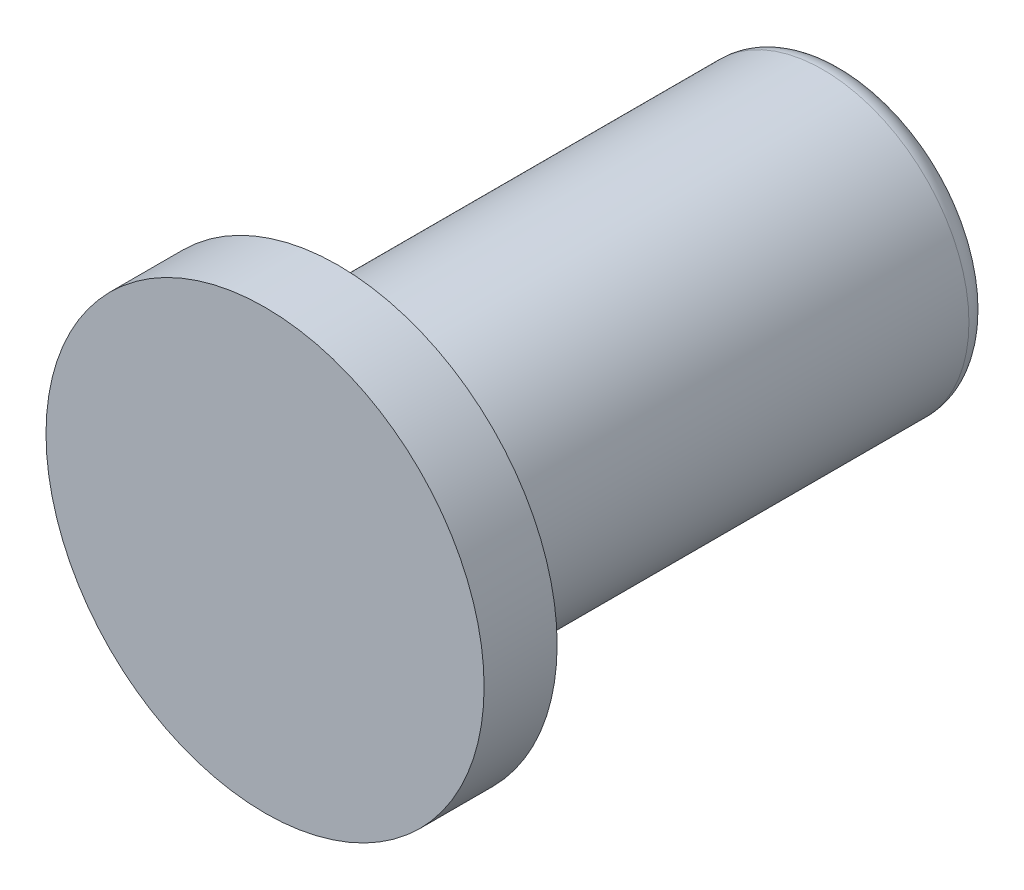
ISO-10303-21;
HEADER;
FILE_DESCRIPTION(('STEP AP214'),'2;1');
FILE_NAME('part.step','',(''),(''),'','','');
FILE_SCHEMA(('AUTOMOTIVE_DESIGN { 1 0 10303 214 1 1 1 1 }'));
ENDSEC;
DATA;
#1=APPLICATION_CONTEXT('core data for automotive mechanical design processes');
#2=APPLICATION_PROTOCOL_DEFINITION('international standard','automotive_design',2000,#1);
#3=PRODUCT_CONTEXT('',#1,'mechanical');
#4=PRODUCT('Part','Part','',(#3));
#5=PRODUCT_RELATED_PRODUCT_CATEGORY('part','',(#4));
#6=PRODUCT_DEFINITION_FORMATION('','',#4);
#7=PRODUCT_DEFINITION_CONTEXT('part definition',#1,'design');
#8=PRODUCT_DEFINITION('design','',#6,#7);
#9=PRODUCT_DEFINITION_SHAPE('','',#8);
#10=(LENGTH_UNIT() NAMED_UNIT(*) SI_UNIT(.MILLI.,.METRE.));
#11=(NAMED_UNIT(*) PLANE_ANGLE_UNIT() SI_UNIT($,.RADIAN.));
#12=(NAMED_UNIT(*) SI_UNIT($,.STERADIAN.) SOLID_ANGLE_UNIT());
#13=UNCERTAINTY_MEASURE_WITH_UNIT(LENGTH_MEASURE(1.E-05),#10,'distance_accuracy_value','');
#14=(GEOMETRIC_REPRESENTATION_CONTEXT(3) GLOBAL_UNCERTAINTY_ASSIGNED_CONTEXT((#13)) GLOBAL_UNIT_ASSIGNED_CONTEXT((#10,
#11,#12)) REPRESENTATION_CONTEXT('',''));
#15=CARTESIAN_POINT('',(0.,0.,0.));
#16=DIRECTION('',(0.,0.,1.));
#17=DIRECTION('',(1.,0.,0.));
#18=AXIS2_PLACEMENT_3D('',#15,#16,#17);
#19=CARTESIAN_POINT('',(0.,0.,0.));
#20=DIRECTION('',(0.,0.,-1.));
#21=DIRECTION('',(-1.,0.,0.));
#22=AXIS2_PLACEMENT_3D('',#19,#20,#21);
#23=PLANE('',#22);
#24=CARTESIAN_POINT('',(0.,0.,0.));
#25=DIRECTION('',(0.,0.,1.));
#26=DIRECTION('',(1.,0.,0.));
#27=AXIS2_PLACEMENT_3D('',#24,#25,#26);
#28=CIRCLE('',#27,15.);
#29=CARTESIAN_POINT('',(15.,0.,0.));
#30=VERTEX_POINT('',#29);
#31=EDGE_CURVE('E11',#30,#30,#28,.T.);
#32=ORIENTED_EDGE('',*,*,#31,.T.);
#33=EDGE_LOOP('',(#32));
#34=FACE_BOUND('',#33,.T.);
#35=ADVANCED_FACE('F33',(#34),#23,.F.);
#36=CARTESIAN_POINT('',(0.,0.,0.));
#37=DIRECTION('',(0.,0.,1.));
#38=DIRECTION('',(1.,0.,0.));
#39=AXIS2_PLACEMENT_3D('',#36,#37,#38);
#40=CYLINDRICAL_SURFACE('',#39,15.);
#41=ORIENTED_EDGE('',*,*,#31,.F.);
#42=EDGE_LOOP('',(#41));
#43=FACE_BOUND('',#42,.T.);
#44=CARTESIAN_POINT('',(0.,0.,-5.));
#45=DIRECTION('',(0.,0.,1.));
#46=DIRECTION('',(1.,0.,0.));
#47=AXIS2_PLACEMENT_3D('',#44,#45,#46);
#48=CIRCLE('',#47,15.);
#49=CARTESIAN_POINT('',(15.,0.,-5.));
#50=VERTEX_POINT('',#49);
#51=EDGE_CURVE('E39',#50,#50,#48,.T.);
#52=ORIENTED_EDGE('',*,*,#51,.T.);
#53=EDGE_LOOP('',(#52));
#54=FACE_BOUND('',#53,.T.);
#55=ADVANCED_FACE('F55',(#43,#54),#40,.T.);
#56=CARTESIAN_POINT('',(0.,15.,-5.));
#57=DIRECTION('',(0.,0.,1.));
#58=DIRECTION('',(1.,0.,0.));
#59=AXIS2_PLACEMENT_3D('',#56,#57,#58);
#60=PLANE('',#59);
#61=ORIENTED_EDGE('',*,*,#51,.F.);
#62=EDGE_LOOP('',(#61));
#63=FACE_BOUND('',#62,.T.);
#64=CARTESIAN_POINT('',(0.,0.,-5.));
#65=DIRECTION('',(0.,0.,1.));
#66=DIRECTION('',(1.,0.,0.));
#67=AXIS2_PLACEMENT_3D('',#64,#65,#66);
#68=CIRCLE('',#67,10.);
#69=CARTESIAN_POINT('',(10.,0.,-5.));
#70=VERTEX_POINT('',#69);
#71=EDGE_CURVE('E67',#70,#70,#68,.T.);
#72=ORIENTED_EDGE('',*,*,#71,.T.);
#73=EDGE_LOOP('',(#72));
#74=FACE_BOUND('',#73,.T.);
#75=ADVANCED_FACE('F60',(#63,#74),#60,.F.);
#76=CARTESIAN_POINT('',(0.,0.,0.));
#77=DIRECTION('',(0.,0.,1.));
#78=DIRECTION('',(1.,0.,0.));
#79=AXIS2_PLACEMENT_3D('',#76,#77,#78);
#80=CYLINDRICAL_SURFACE('',#79,10.);
#81=ORIENTED_EDGE('',*,*,#71,.F.);
#82=EDGE_LOOP('',(#81));
#83=FACE_BOUND('',#82,.T.);
#84=CARTESIAN_POINT('',(0.,0.,-38.2));
#85=DIRECTION('',(0.,0.,1.));
#86=DIRECTION('',(1.,0.,0.));
#87=AXIS2_PLACEMENT_3D('',#84,#85,#86);
#88=CIRCLE('',#87,10.);
#89=CARTESIAN_POINT('',(10.,0.,-38.2));
#90=VERTEX_POINT('',#89);
#91=EDGE_CURVE('E69',#90,#90,#88,.T.);
#92=ORIENTED_EDGE('',*,*,#91,.T.);
#93=EDGE_LOOP('',(#92));
#94=FACE_BOUND('',#93,.T.);
#95=ADVANCED_FACE('F102',(#83,#94),#80,.T.);
#96=CARTESIAN_POINT('',(0.,0.,-38.2));
#97=DIRECTION('',(0.,0.,1.));
#98=DIRECTION('',(1.,0.,0.));
#99=AXIS2_PLACEMENT_3D('',#96,#97,#98);
#100=TOROIDAL_SURFACE('',#99,8.5,1.5);
#101=ORIENTED_EDGE('',*,*,#91,.F.);
#102=EDGE_LOOP('',(#101));
#103=FACE_BOUND('',#102,.T.);
#104=CARTESIAN_POINT('',(0.,0.,-39.7));
#105=DIRECTION('',(0.,0.,1.));
#106=DIRECTION('',(1.,0.,0.));
#107=AXIS2_PLACEMENT_3D('',#104,#105,#106);
#108=CIRCLE('',#107,8.5);
#109=CARTESIAN_POINT('',(8.5,0.,-39.7));
#110=VERTEX_POINT('',#109);
#111=EDGE_CURVE('E74',#110,#110,#108,.T.);
#112=ORIENTED_EDGE('',*,*,#111,.T.);
#113=EDGE_LOOP('',(#112));
#114=FACE_BOUND('',#113,.T.);
#115=ADVANCED_FACE('F95',(#103,#114),#100,.T.);
#116=CARTESIAN_POINT('',(0.,8.5,-39.7));
#117=DIRECTION('',(0.,0.,1.));
#118=DIRECTION('',(1.,0.,0.));
#119=AXIS2_PLACEMENT_3D('',#116,#117,#118);
#120=PLANE('',#119);
#121=ORIENTED_EDGE('',*,*,#111,.F.);
#122=EDGE_LOOP('',(#121));
#123=FACE_BOUND('',#122,.T.);
#124=CARTESIAN_POINT('',(0.,0.,-39.7));
#125=DIRECTION('',(0.,0.,1.));
#126=DIRECTION('',(1.,0.,0.));
#127=AXIS2_PLACEMENT_3D('',#124,#125,#126);
#128=CIRCLE('',#127,4.49999999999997);
#129=CARTESIAN_POINT('',(4.49999999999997,0.,-39.7));
#130=VERTEX_POINT('',#129);
#131=EDGE_CURVE('E77',#130,#130,#128,.T.);
#132=ORIENTED_EDGE('',*,*,#131,.T.);
#133=EDGE_LOOP('',(#132));
#134=FACE_BOUND('',#133,.T.);
#135=ADVANCED_FACE('F89',(#123,#134),#120,.F.);
#136=CARTESIAN_POINT('',(0.,0.,-39.2));
#137=DIRECTION('',(0.,0.,-1.));
#138=DIRECTION('',(-1.,0.,0.));
#139=AXIS2_PLACEMENT_3D('',#136,#137,#138);
#140=CONICAL_SURFACE('',#139,3.99999999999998,0.78539816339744);
#141=ORIENTED_EDGE('',*,*,#131,.F.);
#142=EDGE_LOOP('',(#141));
#143=FACE_BOUND('',#142,.T.);
#144=CARTESIAN_POINT('',(0.,0.,-39.2));
#145=DIRECTION('',(0.,0.,1.));
#146=DIRECTION('',(1.,0.,0.));
#147=AXIS2_PLACEMENT_3D('',#144,#145,#146);
#148=CIRCLE('',#147,3.99999999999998);
#149=CARTESIAN_POINT('',(3.99999999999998,0.,-39.2));
#150=VERTEX_POINT('',#149);
#151=EDGE_CURVE('E80',#150,#150,#148,.T.);
#152=ORIENTED_EDGE('',*,*,#151,.T.);
#153=EDGE_LOOP('',(#152));
#154=FACE_BOUND('',#153,.T.);
#155=ADVANCED_FACE('F50',(#143,#154),#140,.F.);
#156=CARTESIAN_POINT('',(0.,0.,0.));
#157=DIRECTION('',(0.,0.,1.));
#158=DIRECTION('',(1.,0.,0.));
#159=AXIS2_PLACEMENT_3D('',#156,#157,#158);
#160=CYLINDRICAL_SURFACE('',#159,3.99999999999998);
#161=ORIENTED_EDGE('',*,*,#151,.F.);
#162=EDGE_LOOP('',(#161));
#163=FACE_BOUND('',#162,.T.);
#164=CARTESIAN_POINT('',(0.,0.,-30.7));
#165=DIRECTION('',(0.,0.,1.));
#166=DIRECTION('',(1.,0.,0.));
#167=AXIS2_PLACEMENT_3D('',#164,#165,#166);
#168=CIRCLE('',#167,3.99999999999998);
#169=CARTESIAN_POINT('',(3.99999999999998,0.,-30.7));
#170=VERTEX_POINT('',#169);
#171=EDGE_CURVE('E83',#170,#170,#168,.T.);
#172=ORIENTED_EDGE('',*,*,#171,.T.);
#173=EDGE_LOOP('',(#172));
#174=FACE_BOUND('',#173,.T.);
#175=ADVANCED_FACE('F44',(#163,#174),#160,.F.);
#176=CARTESIAN_POINT('',(0.,0.,-28.3905989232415));
#177=DIRECTION('',(0.,0.,-1.));
#178=DIRECTION('',(-1.,0.,0.));
#179=AXIS2_PLACEMENT_3D('',#176,#177,#178);
#180=CONICAL_SURFACE('',#179,0.,1.0471975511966);
#181=ORIENTED_EDGE('',*,*,#171,.F.);
#182=EDGE_LOOP('',(#181));
#183=FACE_BOUND('',#182,.T.);
#184=CARTESIAN_POINT('',(0.,0.,-28.3905989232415));
#185=VERTEX_POINT('',#184);
#186=VERTEX_LOOP('',#185);
#187=FACE_BOUND('',#186,.T.);
#188=ADVANCED_FACE('F42',(#183,#187),#180,.F.);
#189=CLOSED_SHELL('',(#35,#55,#75,#95,#115,#135,#155,#175,#188));
#190=MANIFOLD_SOLID_BREP('B2',#189);
#191=ADVANCED_BREP_SHAPE_REPRESENTATION('',(#18,#190),#14);
#192=SHAPE_DEFINITION_REPRESENTATION(#9,#191);
ENDSEC;
END-ISO-10303-21;
